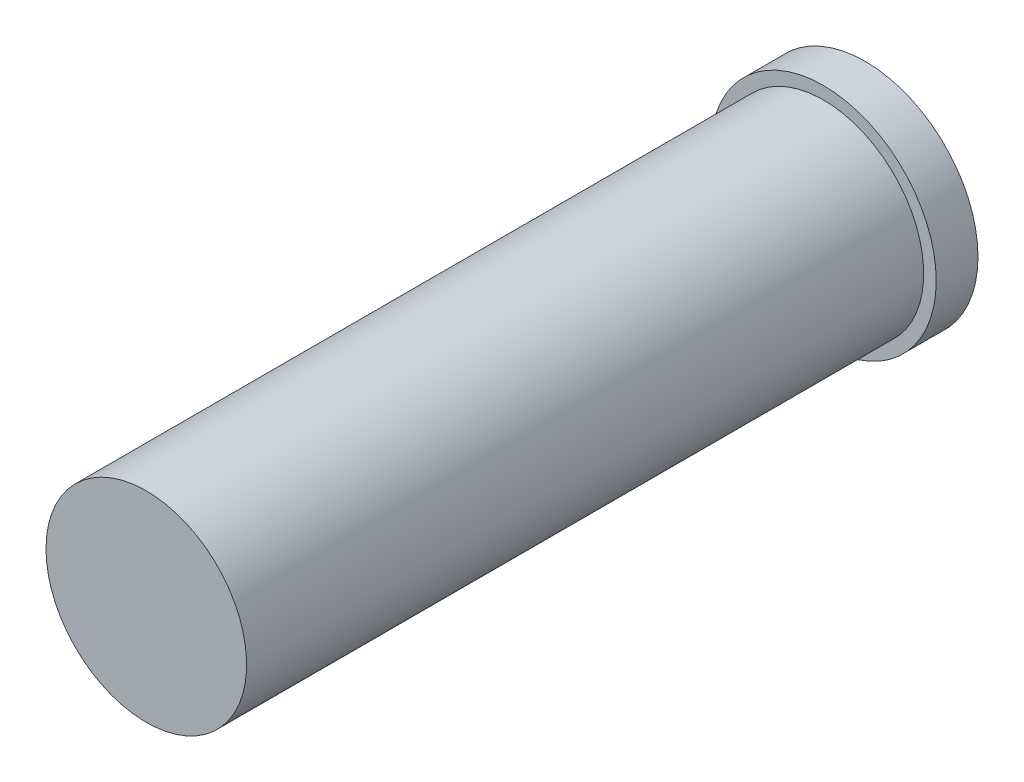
from build123d import *

# Parameters (mm, degrees)
ESQUISSE1_R      = 1.2
EXTRUSION1_DEPTH = 8.6
ESQUISSE2_R      = 1.35
EXTRUSION2_DEPTH = 0.5


with BuildPart() as part:
    # Esquisse1 → Extrusion1 (new body)
    with BuildSketch(Plane.XY):
        with Locations(Location((0, 0, 0), (0, 0, 180))):
            Circle(ESQUISSE1_R)
    extrude(amount=EXTRUSION1_DEPTH)

    # Esquisse2 → Extrusion2 (add)
    with BuildSketch(Plane(origin=(0, 0, 0), x_dir=(-1, 0, 0), z_dir=(0, 0, -1))):
        Circle(ESQUISSE2_R)
    extrude(amount=-EXTRUSION2_DEPTH)


solid = part.part
